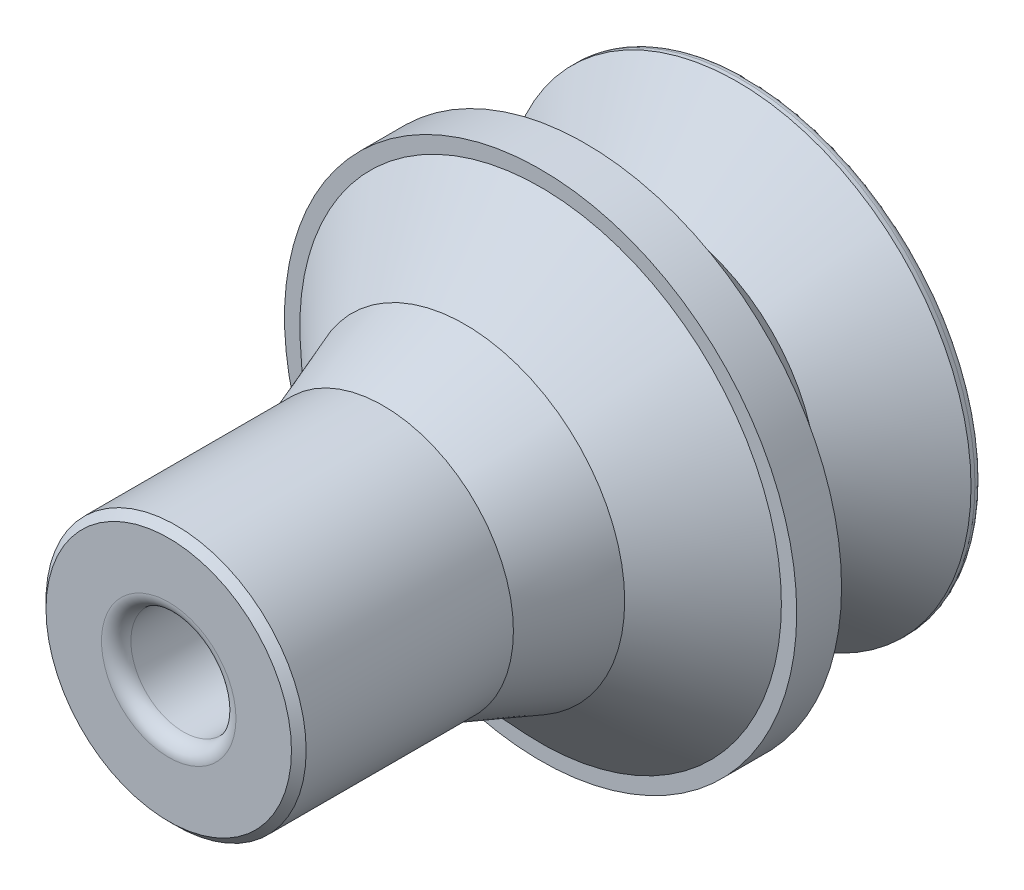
ISO-10303-21;
HEADER;
FILE_DESCRIPTION(('STEP AP214'),'2;1');
FILE_NAME('part.step','',(''),(''),'','','');
FILE_SCHEMA(('AUTOMOTIVE_DESIGN { 1 0 10303 214 1 1 1 1 }'));
ENDSEC;
DATA;
#1=APPLICATION_CONTEXT('core data for automotive mechanical design processes');
#2=APPLICATION_PROTOCOL_DEFINITION('international standard','automotive_design',2000,#1);
#3=PRODUCT_CONTEXT('',#1,'mechanical');
#4=PRODUCT('Part','Part','',(#3));
#5=PRODUCT_RELATED_PRODUCT_CATEGORY('part','',(#4));
#6=PRODUCT_DEFINITION_FORMATION('','',#4);
#7=PRODUCT_DEFINITION_CONTEXT('part definition',#1,'design');
#8=PRODUCT_DEFINITION('design','',#6,#7);
#9=PRODUCT_DEFINITION_SHAPE('','',#8);
#10=(LENGTH_UNIT() NAMED_UNIT(*) SI_UNIT(.MILLI.,.METRE.));
#11=(NAMED_UNIT(*) PLANE_ANGLE_UNIT() SI_UNIT($,.RADIAN.));
#12=(NAMED_UNIT(*) SI_UNIT($,.STERADIAN.) SOLID_ANGLE_UNIT());
#13=UNCERTAINTY_MEASURE_WITH_UNIT(LENGTH_MEASURE(1.E-05),#10,'distance_accuracy_value','');
#14=(GEOMETRIC_REPRESENTATION_CONTEXT(3) GLOBAL_UNCERTAINTY_ASSIGNED_CONTEXT((#13)) GLOBAL_UNIT_ASSIGNED_CONTEXT((#10,
#11,#12)) REPRESENTATION_CONTEXT('',''));
#15=CARTESIAN_POINT('',(0.,0.,0.));
#16=DIRECTION('',(0.,0.,1.));
#17=DIRECTION('',(1.,0.,0.));
#18=AXIS2_PLACEMENT_3D('',#15,#16,#17);
#19=CARTESIAN_POINT('',(0.,0.,-20.0406));
#20=DIRECTION('',(0.,0.,1.));
#21=DIRECTION('',(1.,0.,0.));
#22=AXIS2_PLACEMENT_3D('',#19,#20,#21);
#23=PLANE('',#22);
#24=CARTESIAN_POINT('',(0.,0.,-20.0406));
#25=DIRECTION('',(0.,0.,1.));
#26=DIRECTION('',(1.,0.,0.));
#27=AXIS2_PLACEMENT_3D('',#24,#25,#26);
#28=CIRCLE('',#27,7.3152);
#29=CARTESIAN_POINT('',(7.3152,0.,-20.0406));
#30=VERTEX_POINT('',#29);
#31=EDGE_CURVE('E115',#30,#30,#28,.T.);
#32=ORIENTED_EDGE('',*,*,#31,.T.);
#33=EDGE_LOOP('',(#32));
#34=FACE_BOUND('',#33,.T.);
#35=CARTESIAN_POINT('',(0.,0.,-20.0406));
#36=DIRECTION('',(0.,0.,1.));
#37=DIRECTION('',(1.,0.,0.));
#38=AXIS2_PLACEMENT_3D('',#35,#36,#37);
#39=CIRCLE('',#38,7.8232);
#40=CARTESIAN_POINT('',(7.8232,0.,-20.0406));
#41=VERTEX_POINT('',#40);
#42=EDGE_CURVE('E9',#41,#41,#39,.F.);
#43=ORIENTED_EDGE('',*,*,#42,.T.);
#44=EDGE_LOOP('',(#43));
#45=FACE_BOUND('',#44,.T.);
#46=ADVANCED_FACE('F14',(#34,#45),#23,.F.);
#47=CARTESIAN_POINT('',(0.,0.,-20.0406));
#48=DIRECTION('',(0.,0.,1.));
#49=DIRECTION('',(1.,0.,0.));
#50=AXIS2_PLACEMENT_3D('',#47,#48,#49);
#51=CYLINDRICAL_SURFACE('',#50,8.8519);
#52=CARTESIAN_POINT('',(0.,0.,-12.8524));
#53=DIRECTION('',(0.,0.,1.));
#54=DIRECTION('',(1.,0.,0.));
#55=AXIS2_PLACEMENT_3D('',#52,#53,#54);
#56=CIRCLE('',#55,8.8519);
#57=CARTESIAN_POINT('',(8.8519,0.,-12.8524));
#58=VERTEX_POINT('',#57);
#59=EDGE_CURVE('E59',#58,#58,#56,.T.);
#60=CARTESIAN_POINT('',(0.,0.,-14.4018));
#61=DIRECTION('',(0.,0.,1.));
#62=DIRECTION('',(1.,0.,0.));
#63=AXIS2_PLACEMENT_3D('',#60,#61,#62);
#64=CIRCLE('',#63,8.8519);
#65=CARTESIAN_POINT('',(8.8519,0.,-14.4018));
#66=VERTEX_POINT('',#65);
#67=EDGE_CURVE('E62',#66,#66,#64,.T.);
#68=CARTESIAN_POINT('',(8.8519,0.,-12.8524));
#69=CARTESIAN_POINT('',(8.8519,0.,-12.8685395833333));
#70=CARTESIAN_POINT('',(8.8519,0.,-12.8846791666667));
#71=CARTESIAN_POINT('',(8.8519,0.,-12.9169583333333));
#72=CARTESIAN_POINT('',(8.8519,0.,-12.9330979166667));
#73=CARTESIAN_POINT('',(8.8519,0.,-12.9653770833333));
#74=CARTESIAN_POINT('',(8.8519,0.,-12.9815166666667));
#75=CARTESIAN_POINT('',(8.8519,0.,-13.0137958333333));
#76=CARTESIAN_POINT('',(8.8519,0.,-13.0299354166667));
#77=CARTESIAN_POINT('',(8.8519,0.,-13.0622145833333));
#78=CARTESIAN_POINT('',(8.8519,0.,-13.0783541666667));
#79=CARTESIAN_POINT('',(8.8519,0.,-13.1106333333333));
#80=CARTESIAN_POINT('',(8.8519,0.,-13.1267729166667));
#81=CARTESIAN_POINT('',(8.8519,0.,-13.1590520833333));
#82=CARTESIAN_POINT('',(8.8519,0.,-13.1751916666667));
#83=CARTESIAN_POINT('',(8.8519,0.,-13.2074708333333));
#84=CARTESIAN_POINT('',(8.8519,0.,-13.2236104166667));
#85=CARTESIAN_POINT('',(8.8519,0.,-13.2558895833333));
#86=CARTESIAN_POINT('',(8.8519,0.,-13.2720291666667));
#87=CARTESIAN_POINT('',(8.8519,0.,-13.3043083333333));
#88=CARTESIAN_POINT('',(8.8519,0.,-13.3204479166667));
#89=CARTESIAN_POINT('',(8.8519,0.,-13.3527270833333));
#90=CARTESIAN_POINT('',(8.8519,0.,-13.3688666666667));
#91=CARTESIAN_POINT('',(8.8519,0.,-13.4011458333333));
#92=CARTESIAN_POINT('',(8.8519,0.,-13.4172854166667));
#93=CARTESIAN_POINT('',(8.8519,0.,-13.4495645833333));
#94=CARTESIAN_POINT('',(8.8519,0.,-13.4657041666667));
#95=CARTESIAN_POINT('',(8.8519,0.,-13.4979833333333));
#96=CARTESIAN_POINT('',(8.8519,0.,-13.5141229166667));
#97=CARTESIAN_POINT('',(8.8519,0.,-13.5464020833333));
#98=CARTESIAN_POINT('',(8.8519,0.,-13.5625416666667));
#99=CARTESIAN_POINT('',(8.8519,0.,-13.5948208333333));
#100=CARTESIAN_POINT('',(8.8519,0.,-13.6109604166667));
#101=CARTESIAN_POINT('',(8.8519,0.,-13.6432395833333));
#102=CARTESIAN_POINT('',(8.8519,0.,-13.6593791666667));
#103=CARTESIAN_POINT('',(8.8519,0.,-13.6916583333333));
#104=CARTESIAN_POINT('',(8.8519,0.,-13.7077979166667));
#105=CARTESIAN_POINT('',(8.8519,0.,-13.7400770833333));
#106=CARTESIAN_POINT('',(8.8519,0.,-13.7562166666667));
#107=CARTESIAN_POINT('',(8.8519,0.,-13.7884958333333));
#108=CARTESIAN_POINT('',(8.8519,0.,-13.8046354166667));
#109=CARTESIAN_POINT('',(8.8519,0.,-13.8369145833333));
#110=CARTESIAN_POINT('',(8.8519,0.,-13.8530541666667));
#111=CARTESIAN_POINT('',(8.8519,0.,-13.8853333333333));
#112=CARTESIAN_POINT('',(8.8519,0.,-13.9014729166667));
#113=CARTESIAN_POINT('',(8.8519,0.,-13.9337520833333));
#114=CARTESIAN_POINT('',(8.8519,0.,-13.9498916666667));
#115=CARTESIAN_POINT('',(8.8519,0.,-13.9821708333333));
#116=CARTESIAN_POINT('',(8.8519,0.,-13.9983104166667));
#117=CARTESIAN_POINT('',(8.8519,0.,-14.0305895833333));
#118=CARTESIAN_POINT('',(8.8519,0.,-14.0467291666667));
#119=CARTESIAN_POINT('',(8.8519,0.,-14.0790083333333));
#120=CARTESIAN_POINT('',(8.8519,0.,-14.0951479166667));
#121=CARTESIAN_POINT('',(8.8519,0.,-14.1274270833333));
#122=CARTESIAN_POINT('',(8.8519,0.,-14.1435666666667));
#123=CARTESIAN_POINT('',(8.8519,0.,-14.1758458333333));
#124=CARTESIAN_POINT('',(8.8519,0.,-14.1919854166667));
#125=CARTESIAN_POINT('',(8.8519,0.,-14.2242645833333));
#126=CARTESIAN_POINT('',(8.8519,0.,-14.2404041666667));
#127=CARTESIAN_POINT('',(8.8519,0.,-14.2726833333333));
#128=CARTESIAN_POINT('',(8.8519,0.,-14.2888229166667));
#129=CARTESIAN_POINT('',(8.8519,0.,-14.3211020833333));
#130=CARTESIAN_POINT('',(8.8519,0.,-14.3372416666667));
#131=CARTESIAN_POINT('',(8.8519,0.,-14.3695208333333));
#132=CARTESIAN_POINT('',(8.8519,0.,-14.3856604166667));
#133=CARTESIAN_POINT('',(8.8519,0.,-14.4018));
#134=B_SPLINE_CURVE_WITH_KNOTS('',3,(#68,#69,#70,#71,#72,#73,#74,#75,#76,#77,#78,#79,#80,#81,
#82,#83,#84,#85,#86,#87,#88,#89,#90,#91,#92,#93,#94,#95,#96,#97,#98,#99,#100,#101,#102,#103,
#104,#105,#106,#107,#108,#109,#110,#111,#112,#113,#114,#115,#116,#117,#118,#119,#120,#121,#122,
#123,#124,#125,#126,#127,#128,#129,#130,#131,#132,#133),.UNSPECIFIED.,.F.,.F.,(4,2,2,2,2,2,2,2,
2,2,2,2,2,2,2,2,2,2,2,2,2,2,2,2,2,2,2,2,2,2,2,2,4),(0.,0.0484187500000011,0.0968374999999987,
0.14525625,0.193674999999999,0.242093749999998,0.290512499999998,0.338931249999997,
0.387349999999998,0.435768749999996,0.484187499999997,0.532606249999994,0.581024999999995,
0.629443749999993,0.677862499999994,0.726281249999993,0.774699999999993,0.823118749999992,
0.871537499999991,0.919956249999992,0.96837499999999,1.01679374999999,1.06521249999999,
1.11363124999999,1.16204999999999,1.21046874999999,1.25888749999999,1.30730624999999,
1.35572499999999,1.40414374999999,1.45256249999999,1.50098124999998,1.54939999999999),.UNSPECIFIED.);
#135=EDGE_CURVE('BSEAM138',#58,#66,#134,.T.);
#136=ORIENTED_EDGE('',*,*,#59,.F.);
#137=ORIENTED_EDGE('',*,*,#67,.T.);
#138=ORIENTED_EDGE('',*,*,#135,.T.);
#139=ORIENTED_EDGE('',*,*,#135,.F.);
#140=EDGE_LOOP('',(#136,#138,#137,#139));
#141=FACE_BOUND('',#140,.T.);
#142=ADVANCED_FACE('F138',(#141),#51,.T.);
#143=CARTESIAN_POINT('',(0.,0.,0.));
#144=DIRECTION('',(0.,0.,1.));
#145=DIRECTION('',(1.,0.,0.));
#146=AXIS2_PLACEMENT_3D('',#143,#144,#145);
#147=CYLINDRICAL_SURFACE('',#146,4.4958);
#148=CARTESIAN_POINT('',(0.,0.,-0.254000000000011));
#149=DIRECTION('',(0.,0.,1.));
#150=DIRECTION('',(1.,0.,0.));
#151=AXIS2_PLACEMENT_3D('',#148,#149,#150);
#152=CIRCLE('',#151,4.4958);
#153=CARTESIAN_POINT('',(4.4958,0.,-0.254000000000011));
#154=VERTEX_POINT('',#153);
#155=EDGE_CURVE('E32',#154,#154,#152,.F.);
#156=ORIENTED_EDGE('',*,*,#155,.T.);
#157=EDGE_LOOP('',(#156));
#158=FACE_BOUND('',#157,.T.);
#159=CARTESIAN_POINT('',(0.,0.,-7.4168));
#160=DIRECTION('',(0.,0.,1.));
#161=DIRECTION('',(1.,0.,0.));
#162=AXIS2_PLACEMENT_3D('',#159,#160,#161);
#163=CIRCLE('',#162,4.4958);
#164=CARTESIAN_POINT('',(4.4958,0.,-7.4168));
#165=VERTEX_POINT('',#164);
#166=EDGE_CURVE('E47',#165,#165,#163,.T.);
#167=ORIENTED_EDGE('',*,*,#166,.T.);
#168=EDGE_LOOP('',(#167));
#169=FACE_BOUND('',#168,.T.);
#170=ADVANCED_FACE('F144',(#158,#169),#147,.T.);
#171=CARTESIAN_POINT('',(0.,0.,-7.4168));
#172=DIRECTION('',(0.,0.,-1.));
#173=DIRECTION('',(-1.,0.,0.));
#174=AXIS2_PLACEMENT_3D('',#171,#172,#173);
#175=CONICAL_SURFACE('',#174,4.4958,0.349065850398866);
#176=CARTESIAN_POINT('',(0.,0.,-10.2362));
#177=DIRECTION('',(0.,0.,1.));
#178=DIRECTION('',(1.,0.,0.));
#179=AXIS2_PLACEMENT_3D('',#176,#177,#178);
#180=CIRCLE('',#179,5.52197767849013);
#181=CARTESIAN_POINT('',(5.52197767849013,0.,-10.2362));
#182=VERTEX_POINT('',#181);
#183=EDGE_CURVE('E51',#182,#182,#180,.T.);
#184=ORIENTED_EDGE('',*,*,#183,.T.);
#185=EDGE_LOOP('',(#184));
#186=FACE_BOUND('',#185,.T.);
#187=ORIENTED_EDGE('',*,*,#166,.F.);
#188=EDGE_LOOP('',(#187));
#189=FACE_BOUND('',#188,.T.);
#190=ADVANCED_FACE('F172',(#186,#189),#175,.T.);
#191=CARTESIAN_POINT('',(0.,0.,-10.2362));
#192=DIRECTION('',(0.,0.,-1.));
#193=DIRECTION('',(-1.,0.,0.));
#194=AXIS2_PLACEMENT_3D('',#191,#192,#193);
#195=CONICAL_SURFACE('',#194,5.52197767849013,0.81925755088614);
#196=CARTESIAN_POINT('',(0.,0.,-12.8524));
#197=DIRECTION('',(0.,0.,1.));
#198=DIRECTION('',(1.,0.,0.));
#199=AXIS2_PLACEMENT_3D('',#196,#197,#198);
#200=CIRCLE('',#199,8.32162506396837);
#201=CARTESIAN_POINT('',(8.32162506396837,0.,-12.8524));
#202=VERTEX_POINT('',#201);
#203=EDGE_CURVE('E55',#202,#202,#200,.T.);
#204=ORIENTED_EDGE('',*,*,#203,.T.);
#205=EDGE_LOOP('',(#204));
#206=FACE_BOUND('',#205,.T.);
#207=ORIENTED_EDGE('',*,*,#183,.F.);
#208=EDGE_LOOP('',(#207));
#209=FACE_BOUND('',#208,.T.);
#210=ADVANCED_FACE('F176',(#206,#209),#195,.T.);
#211=CARTESIAN_POINT('',(0.,8.32162506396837,-12.8524));
#212=DIRECTION('',(0.,0.,1.));
#213=DIRECTION('',(1.,0.,0.));
#214=AXIS2_PLACEMENT_3D('',#211,#212,#213);
#215=PLANE('',#214);
#216=ORIENTED_EDGE('',*,*,#59,.T.);
#217=EDGE_LOOP('',(#216));
#218=FACE_BOUND('',#217,.T.);
#219=ORIENTED_EDGE('',*,*,#203,.F.);
#220=EDGE_LOOP('',(#219));
#221=FACE_BOUND('',#220,.T.);
#222=ADVANCED_FACE('F153',(#218,#221),#215,.T.);
#223=CARTESIAN_POINT('',(0.,0.,0.));
#224=DIRECTION('',(0.,0.,1.));
#225=DIRECTION('',(1.,0.,0.));
#226=AXIS2_PLACEMENT_3D('',#223,#224,#225);
#227=PLANE('',#226);
#228=CARTESIAN_POINT('',(0.,0.,0.));
#229=DIRECTION('',(0.,0.,1.));
#230=DIRECTION('',(1.,0.,0.));
#231=AXIS2_PLACEMENT_3D('',#228,#229,#230);
#232=CIRCLE('',#231,2.3241);
#233=CARTESIAN_POINT('',(2.3241,0.,0.));
#234=VERTEX_POINT('',#233);
#235=EDGE_CURVE('E111',#234,#234,#232,.F.);
#236=ORIENTED_EDGE('',*,*,#235,.T.);
#237=EDGE_LOOP('',(#236));
#238=FACE_BOUND('',#237,.T.);
#239=CARTESIAN_POINT('',(0.,0.,0.));
#240=DIRECTION('',(0.,0.,1.));
#241=DIRECTION('',(1.,0.,0.));
#242=AXIS2_PLACEMENT_3D('',#239,#240,#241);
#243=CIRCLE('',#242,4.24179999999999);
#244=CARTESIAN_POINT('',(4.24179999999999,0.,0.));
#245=VERTEX_POINT('',#244);
#246=EDGE_CURVE('E41',#245,#245,#243,.T.);
#247=ORIENTED_EDGE('',*,*,#246,.T.);
#248=EDGE_LOOP('',(#247));
#249=FACE_BOUND('',#248,.T.);
#250=ADVANCED_FACE('F150',(#238,#249),#227,.T.);
#251=CARTESIAN_POINT('',(0.,0.,0.));
#252=DIRECTION('',(0.,0.,-1.));
#253=DIRECTION('',(-1.,0.,0.));
#254=AXIS2_PLACEMENT_3D('',#251,#252,#253);
#255=CONICAL_SURFACE('',#254,4.24179999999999,0.785398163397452);
#256=ORIENTED_EDGE('',*,*,#155,.F.);
#257=EDGE_LOOP('',(#256));
#258=FACE_BOUND('',#257,.T.);
#259=ORIENTED_EDGE('',*,*,#246,.F.);
#260=EDGE_LOOP('',(#259));
#261=FACE_BOUND('',#260,.T.);
#262=ADVANCED_FACE('F152',(#258,#261),#255,.T.);
#263=CARTESIAN_POINT('',(0.,8.8519,-14.4018));
#264=DIRECTION('',(0.,0.,-1.));
#265=DIRECTION('',(-1.,0.,0.));
#266=AXIS2_PLACEMENT_3D('',#263,#264,#265);
#267=PLANE('',#266);
#268=CARTESIAN_POINT('',(0.,0.,-14.4018));
#269=DIRECTION('',(0.,0.,1.));
#270=DIRECTION('',(1.,0.,0.));
#271=AXIS2_PLACEMENT_3D('',#268,#269,#270);
#272=CIRCLE('',#271,8.523258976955);
#273=CARTESIAN_POINT('',(8.523258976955,0.,-14.4018));
#274=VERTEX_POINT('',#273);
#275=EDGE_CURVE('E66',#274,#274,#272,.T.);
#276=ORIENTED_EDGE('',*,*,#275,.T.);
#277=EDGE_LOOP('',(#276));
#278=FACE_BOUND('',#277,.T.);
#279=ORIENTED_EDGE('',*,*,#67,.F.);
#280=EDGE_LOOP('',(#279));
#281=FACE_BOUND('',#280,.T.);
#282=ADVANCED_FACE('F156',(#278,#281),#267,.T.);
#283=CARTESIAN_POINT('',(0.,0.,-14.4018));
#284=DIRECTION('',(0.,0.,1.));
#285=DIRECTION('',(1.,0.,0.));
#286=AXIS2_PLACEMENT_3D('',#283,#284,#285);
#287=CONICAL_SURFACE('',#286,8.523258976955,0.87475902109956);
#288=CARTESIAN_POINT('',(0.,0.,-17.1196));
#289=DIRECTION('',(0.,0.,1.));
#290=DIRECTION('',(1.,0.,0.));
#291=AXIS2_PLACEMENT_3D('',#288,#289,#290);
#292=CIRCLE('',#291,5.2705);
#293=CARTESIAN_POINT('',(5.2705,0.,-17.1196));
#294=VERTEX_POINT('',#293);
#295=EDGE_CURVE('E70',#294,#294,#292,.T.);
#296=ORIENTED_EDGE('',*,*,#295,.T.);
#297=EDGE_LOOP('',(#296));
#298=FACE_BOUND('',#297,.T.);
#299=ORIENTED_EDGE('',*,*,#275,.F.);
#300=EDGE_LOOP('',(#299));
#301=FACE_BOUND('',#300,.T.);
#302=ADVANCED_FACE('F162',(#298,#301),#287,.T.);
#303=CARTESIAN_POINT('',(0.,0.,-17.1196));
#304=DIRECTION('',(0.,0.,-1.));
#305=DIRECTION('',(-1.,0.,0.));
#306=AXIS2_PLACEMENT_3D('',#303,#304,#305);
#307=CONICAL_SURFACE('',#306,5.2705,0.836885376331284);
#308=CARTESIAN_POINT('',(0.,0.,-19.6512025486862));
#309=DIRECTION('',(0.,0.,1.));
#310=DIRECTION('',(1.,0.,0.));
#311=AXIS2_PLACEMENT_3D('',#308,#309,#310);
#312=CIRCLE('',#311,8.0772);
#313=CARTESIAN_POINT('',(8.0772,0.,-19.6512025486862));
#314=VERTEX_POINT('',#313);
#315=EDGE_CURVE('E74',#314,#314,#312,.T.);
#316=ORIENTED_EDGE('',*,*,#315,.T.);
#317=EDGE_LOOP('',(#316));
#318=FACE_BOUND('',#317,.T.);
#319=ORIENTED_EDGE('',*,*,#295,.F.);
#320=EDGE_LOOP('',(#319));
#321=FACE_BOUND('',#320,.T.);
#322=ADVANCED_FACE('F190',(#318,#321),#307,.T.);
#323=CARTESIAN_POINT('',(0.,0.,0.));
#324=DIRECTION('',(0.,0.,1.));
#325=DIRECTION('',(1.,0.,0.));
#326=AXIS2_PLACEMENT_3D('',#323,#324,#325);
#327=CYLINDRICAL_SURFACE('',#326,8.0772);
#328=CARTESIAN_POINT('',(0.,0.,-19.7866));
#329=DIRECTION('',(0.,0.,1.));
#330=DIRECTION('',(1.,0.,0.));
#331=AXIS2_PLACEMENT_3D('',#328,#329,#330);
#332=CIRCLE('',#331,8.0772);
#333=CARTESIAN_POINT('',(8.0772,0.,-19.7866));
#334=VERTEX_POINT('',#333);
#335=EDGE_CURVE('E22',#334,#334,#332,.T.);
#336=ORIENTED_EDGE('',*,*,#335,.T.);
#337=EDGE_LOOP('',(#336));
#338=FACE_BOUND('',#337,.T.);
#339=ORIENTED_EDGE('',*,*,#315,.F.);
#340=EDGE_LOOP('',(#339));
#341=FACE_BOUND('',#340,.T.);
#342=ADVANCED_FACE('F194',(#338,#341),#327,.T.);
#343=CARTESIAN_POINT('',(0.,0.,-19.7866));
#344=DIRECTION('',(0.,0.,1.));
#345=DIRECTION('',(1.,0.,0.));
#346=AXIS2_PLACEMENT_3D('',#343,#344,#345);
#347=TOROIDAL_SURFACE('',#346,7.8232,0.254);
#348=ORIENTED_EDGE('',*,*,#42,.F.);
#349=EDGE_LOOP('',(#348));
#350=FACE_BOUND('',#349,.T.);
#351=ORIENTED_EDGE('',*,*,#335,.F.);
#352=EDGE_LOOP('',(#351));
#353=FACE_BOUND('',#352,.T.);
#354=ADVANCED_FACE('F16',(#350,#353),#347,.T.);
#355=CARTESIAN_POINT('',(0.,0.,-0.508000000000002));
#356=DIRECTION('',(0.,0.,1.));
#357=DIRECTION('',(1.,0.,0.));
#358=AXIS2_PLACEMENT_3D('',#355,#356,#357);
#359=TOROIDAL_SURFACE('',#358,2.3241,0.508);
#360=ORIENTED_EDGE('',*,*,#235,.F.);
#361=EDGE_LOOP('',(#360));
#362=FACE_BOUND('',#361,.T.);
#363=CARTESIAN_POINT('',(0.,0.,-0.508000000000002));
#364=DIRECTION('',(0.,0.,1.));
#365=DIRECTION('',(1.,0.,0.));
#366=AXIS2_PLACEMENT_3D('',#363,#364,#365);
#367=CIRCLE('',#366,1.8161);
#368=CARTESIAN_POINT('',(1.8161,0.,-0.508000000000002));
#369=VERTEX_POINT('',#368);
#370=EDGE_CURVE('E77',#369,#369,#367,.T.);
#371=ORIENTED_EDGE('',*,*,#370,.F.);
#372=EDGE_LOOP('',(#371));
#373=FACE_BOUND('',#372,.T.);
#374=ADVANCED_FACE('F198',(#362,#373),#359,.T.);
#375=CARTESIAN_POINT('',(0.,0.,-20.0416));
#376=DIRECTION('',(0.,0.,1.));
#377=DIRECTION('',(1.,0.,0.));
#378=AXIS2_PLACEMENT_3D('',#375,#376,#377);
#379=CYLINDRICAL_SURFACE('',#378,1.8161);
#380=ORIENTED_EDGE('',*,*,#370,.T.);
#381=EDGE_LOOP('',(#380));
#382=FACE_BOUND('',#381,.T.);
#383=CARTESIAN_POINT('',(0.,0.,-2.8448));
#384=DIRECTION('',(0.,0.,-1.));
#385=DIRECTION('',(-1.,0.,0.));
#386=AXIS2_PLACEMENT_3D('',#383,#384,#385);
#387=CIRCLE('',#386,1.8161);
#388=CARTESIAN_POINT('',(-1.8161,0.,-2.8448));
#389=VERTEX_POINT('',#388);
#390=EDGE_CURVE('E81',#389,#389,#387,.F.);
#391=ORIENTED_EDGE('',*,*,#390,.F.);
#392=EDGE_LOOP('',(#391));
#393=FACE_BOUND('',#392,.T.);
#394=ADVANCED_FACE('F201',(#382,#393),#379,.F.);
#395=CARTESIAN_POINT('',(0.,0.,-2.8448));
#396=DIRECTION('',(0.,0.,-1.));
#397=DIRECTION('',(-1.,0.,0.));
#398=AXIS2_PLACEMENT_3D('',#395,#396,#397);
#399=PLANE('',#398);
#400=ORIENTED_EDGE('',*,*,#390,.T.);
#401=EDGE_LOOP('',(#400));
#402=FACE_BOUND('',#401,.T.);
#403=CARTESIAN_POINT('',(0.,0.,-2.8448));
#404=DIRECTION('',(0.,0.,1.));
#405=DIRECTION('',(1.,0.,0.));
#406=AXIS2_PLACEMENT_3D('',#403,#404,#405);
#407=CIRCLE('',#406,2.4384);
#408=CARTESIAN_POINT('',(2.4384,0.,-2.8448));
#409=VERTEX_POINT('',#408);
#410=EDGE_CURVE('E84',#409,#409,#407,.T.);
#411=ORIENTED_EDGE('',*,*,#410,.F.);
#412=EDGE_LOOP('',(#411));
#413=FACE_BOUND('',#412,.T.);
#414=ADVANCED_FACE('F205',(#402,#413),#399,.T.);
#415=CARTESIAN_POINT('',(0.,0.,-2.9718));
#416=DIRECTION('',(0.,0.,1.));
#417=DIRECTION('',(1.,0.,0.));
#418=AXIS2_PLACEMENT_3D('',#415,#416,#417);
#419=TOROIDAL_SURFACE('',#418,2.4384,0.127);
#420=ORIENTED_EDGE('',*,*,#410,.T.);
#421=EDGE_LOOP('',(#420));
#422=FACE_BOUND('',#421,.T.);
#423=CARTESIAN_POINT('',(0.,0.,-2.9718));
#424=DIRECTION('',(0.,0.,1.));
#425=DIRECTION('',(1.,0.,0.));
#426=AXIS2_PLACEMENT_3D('',#423,#424,#425);
#427=CIRCLE('',#426,2.5654);
#428=CARTESIAN_POINT('',(2.5654,0.,-2.9718));
#429=VERTEX_POINT('',#428);
#430=EDGE_CURVE('E88',#429,#429,#427,.T.);
#431=ORIENTED_EDGE('',*,*,#430,.F.);
#432=EDGE_LOOP('',(#431));
#433=FACE_BOUND('',#432,.T.);
#434=ADVANCED_FACE('F209',(#422,#433),#419,.F.);
#435=CARTESIAN_POINT('',(0.,0.,0.));
#436=DIRECTION('',(0.,0.,1.));
#437=DIRECTION('',(1.,0.,0.));
#438=AXIS2_PLACEMENT_3D('',#435,#436,#437);
#439=CYLINDRICAL_SURFACE('',#438,2.5654);
#440=ORIENTED_EDGE('',*,*,#430,.T.);
#441=EDGE_LOOP('',(#440));
#442=FACE_BOUND('',#441,.T.);
#443=CARTESIAN_POINT('',(0.,0.,-10.0878303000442));
#444=DIRECTION('',(0.,0.,1.));
#445=DIRECTION('',(1.,0.,0.));
#446=AXIS2_PLACEMENT_3D('',#443,#444,#445);
#447=CIRCLE('',#446,2.5654);
#448=CARTESIAN_POINT('',(2.5654,0.,-10.0878303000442));
#449=VERTEX_POINT('',#448);
#450=EDGE_CURVE('E92',#449,#449,#447,.T.);
#451=ORIENTED_EDGE('',*,*,#450,.F.);
#452=EDGE_LOOP('',(#451));
#453=FACE_BOUND('',#452,.T.);
#454=ADVANCED_FACE('F213',(#442,#453),#439,.F.);
#455=CARTESIAN_POINT('',(0.,0.,-13.4433709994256));
#456=DIRECTION('',(0.,0.,-1.));
#457=DIRECTION('',(-1.,0.,0.));
#458=AXIS2_PLACEMENT_3D('',#455,#456,#457);
#459=CONICAL_SURFACE('',#458,6.91951350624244,0.914203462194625);
#460=ORIENTED_EDGE('',*,*,#450,.T.);
#461=EDGE_LOOP('',(#460));
#462=FACE_BOUND('',#461,.T.);
#463=CARTESIAN_POINT('',(0.,0.,-13.4433709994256));
#464=DIRECTION('',(0.,0.,1.));
#465=DIRECTION('',(1.,0.,0.));
#466=AXIS2_PLACEMENT_3D('',#463,#464,#465);
#467=CIRCLE('',#466,6.91951350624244);
#468=CARTESIAN_POINT('',(6.91951350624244,0.,-13.4433709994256));
#469=VERTEX_POINT('',#468);
#470=EDGE_CURVE('E96',#469,#469,#467,.T.);
#471=ORIENTED_EDGE('',*,*,#470,.F.);
#472=EDGE_LOOP('',(#471));
#473=FACE_BOUND('',#472,.T.);
#474=ADVANCED_FACE('F217',(#462,#473),#459,.F.);
#475=CARTESIAN_POINT('',(0.,0.,-13.7537459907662));
#476=DIRECTION('',(0.,0.,1.));
#477=DIRECTION('',(1.,0.,0.));
#478=AXIS2_PLACEMENT_3D('',#475,#476,#477);
#479=TOROIDAL_SURFACE('',#478,6.68031994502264,0.391849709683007);
#480=ORIENTED_EDGE('',*,*,#470,.T.);
#481=EDGE_LOOP('',(#480));
#482=FACE_BOUND('',#481,.T.);
#483=CARTESIAN_POINT('',(0.,0.,-14.0544471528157));
#484=DIRECTION('',(0.,0.,1.));
#485=DIRECTION('',(1.,0.,0.));
#486=AXIS2_PLACEMENT_3D('',#483,#484,#485);
#487=CIRCLE('',#486,6.93156684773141);
#488=CARTESIAN_POINT('',(6.93156684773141,0.,-14.0544471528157));
#489=VERTEX_POINT('',#488);
#490=EDGE_CURVE('E100',#489,#489,#487,.T.);
#491=ORIENTED_EDGE('',*,*,#490,.F.);
#492=EDGE_LOOP('',(#491));
#493=FACE_BOUND('',#492,.T.);
#494=ADVANCED_FACE('F221',(#482,#493),#479,.F.);
#495=CARTESIAN_POINT('',(0.,0.,-16.0303121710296));
#496=DIRECTION('',(0.,0.,1.));
#497=DIRECTION('',(1.,0.,0.));
#498=AXIS2_PLACEMENT_3D('',#495,#496,#497);
#499=CONICAL_SURFACE('',#498,4.56678184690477,0.874759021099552);
#500=ORIENTED_EDGE('',*,*,#490,.T.);
#501=EDGE_LOOP('',(#500));
#502=FACE_BOUND('',#501,.T.);
#503=CARTESIAN_POINT('',(0.,0.,-16.0303121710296));
#504=DIRECTION('',(0.,0.,1.));
#505=DIRECTION('',(1.,0.,0.));
#506=AXIS2_PLACEMENT_3D('',#503,#504,#505);
#507=CIRCLE('',#506,4.56678184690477);
#508=CARTESIAN_POINT('',(4.56678184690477,0.,-16.0303121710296));
#509=VERTEX_POINT('',#508);
#510=EDGE_CURVE('E103',#509,#509,#507,.T.);
#511=ORIENTED_EDGE('',*,*,#510,.F.);
#512=EDGE_LOOP('',(#511));
#513=FACE_BOUND('',#512,.T.);
#514=ADVANCED_FACE('F134',(#502,#513),#499,.F.);
#515=CARTESIAN_POINT('',(0.,0.,-17.1803132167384));
#516=DIRECTION('',(0.,0.,1.));
#517=DIRECTION('',(1.,0.,0.));
#518=AXIS2_PLACEMENT_3D('',#515,#516,#517);
#519=TOROIDAL_SURFACE('',#518,5.52765010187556,1.49858940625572);
#520=ORIENTED_EDGE('',*,*,#510,.T.);
#521=EDGE_LOOP('',(#520));
#522=FACE_BOUND('',#521,.T.);
#523=CARTESIAN_POINT('',(0.,0.,-18.4564570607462));
#524=DIRECTION('',(0.,0.,1.));
#525=DIRECTION('',(1.,0.,0.));
#526=AXIS2_PLACEMENT_3D('',#523,#524,#525);
#527=CIRCLE('',#526,4.7420120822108);
#528=CARTESIAN_POINT('',(4.7420120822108,0.,-18.4564570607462));
#529=VERTEX_POINT('',#528);
#530=EDGE_CURVE('E107',#529,#529,#527,.T.);
#531=ORIENTED_EDGE('',*,*,#530,.F.);
#532=EDGE_LOOP('',(#531));
#533=FACE_BOUND('',#532,.T.);
#534=ADVANCED_FACE('F126',(#522,#533),#519,.T.);
#535=CARTESIAN_POINT('',(0.,0.,-20.0406));
#536=DIRECTION('',(0.,0.,-1.));
#537=DIRECTION('',(-1.,0.,0.));
#538=AXIS2_PLACEMENT_3D('',#535,#536,#537);
#539=CONICAL_SURFACE('',#538,7.3152,1.01896020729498);
#540=ORIENTED_EDGE('',*,*,#530,.T.);
#541=EDGE_LOOP('',(#540));
#542=FACE_BOUND('',#541,.T.);
#543=ORIENTED_EDGE('',*,*,#31,.F.);
#544=EDGE_LOOP('',(#543));
#545=FACE_BOUND('',#544,.T.);
#546=ADVANCED_FACE('F124',(#542,#545),#539,.F.);
#547=CLOSED_SHELL('',(#46,#142,#170,#190,#210,#222,#250,#262,#282,#302,#322,#342,#354,#374,#394,
#414,#434,#454,#474,#494,#514,#534,#546));
#548=MANIFOLD_SOLID_BREP('B1',#547);
#549=ADVANCED_BREP_SHAPE_REPRESENTATION('',(#18,#548),#14);
#550=SHAPE_DEFINITION_REPRESENTATION(#9,#549);
ENDSEC;
END-ISO-10303-21;
